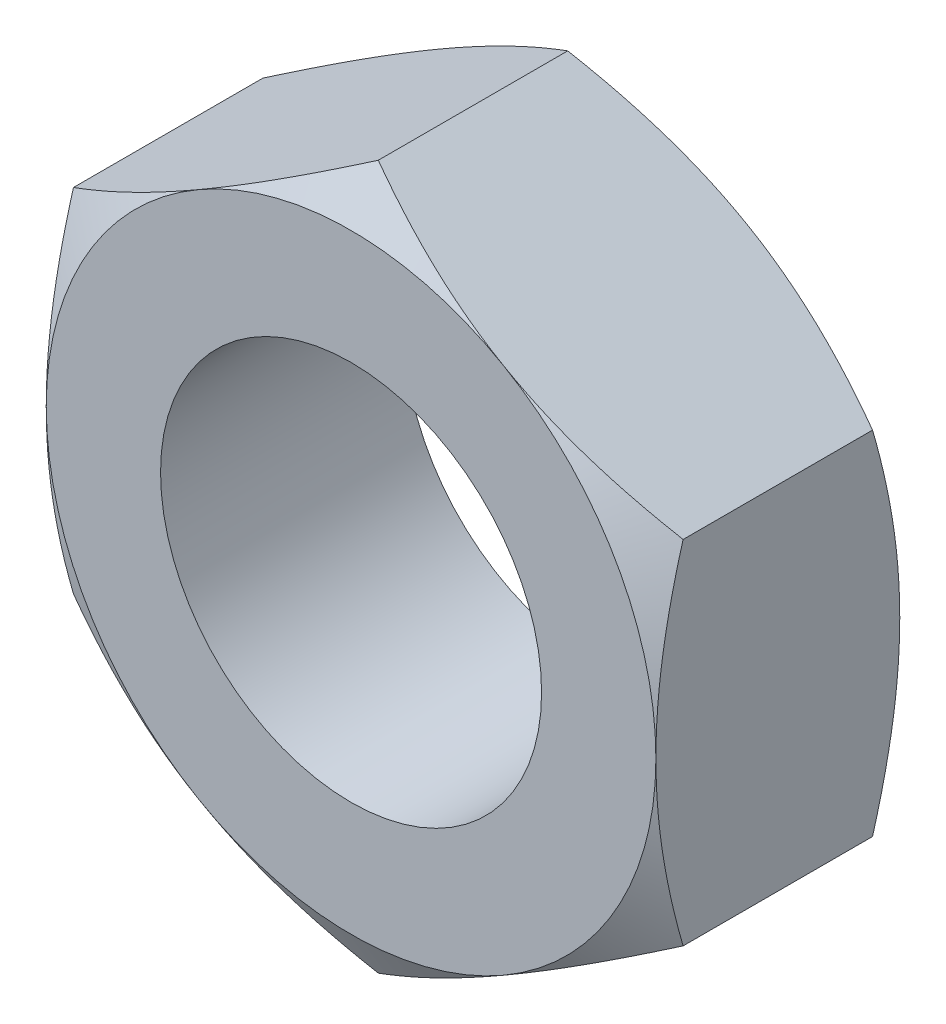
ISO-10303-21;
HEADER;
FILE_DESCRIPTION(('STEP AP214'),'2;1');
FILE_NAME('part.step','',(''),(''),'','','');
FILE_SCHEMA(('AUTOMOTIVE_DESIGN { 1 0 10303 214 1 1 1 1 }'));
ENDSEC;
DATA;
#1=APPLICATION_CONTEXT('core data for automotive mechanical design processes');
#2=APPLICATION_PROTOCOL_DEFINITION('international standard','automotive_design',2000,#1);
#3=PRODUCT_CONTEXT('',#1,'mechanical');
#4=PRODUCT('Part','Part','',(#3));
#5=PRODUCT_RELATED_PRODUCT_CATEGORY('part','',(#4));
#6=PRODUCT_DEFINITION_FORMATION('','',#4);
#7=PRODUCT_DEFINITION_CONTEXT('part definition',#1,'design');
#8=PRODUCT_DEFINITION('design','',#6,#7);
#9=PRODUCT_DEFINITION_SHAPE('','',#8);
#10=(LENGTH_UNIT() NAMED_UNIT(*) SI_UNIT(.MILLI.,.METRE.));
#11=(NAMED_UNIT(*) PLANE_ANGLE_UNIT() SI_UNIT($,.RADIAN.));
#12=(NAMED_UNIT(*) SI_UNIT($,.STERADIAN.) SOLID_ANGLE_UNIT());
#13=UNCERTAINTY_MEASURE_WITH_UNIT(LENGTH_MEASURE(1.E-05),#10,'distance_accuracy_value','');
#14=(GEOMETRIC_REPRESENTATION_CONTEXT(3) GLOBAL_UNCERTAINTY_ASSIGNED_CONTEXT((#13)) GLOBAL_UNIT_ASSIGNED_CONTEXT((#10,
#11,#12)) REPRESENTATION_CONTEXT('',''));
#15=CARTESIAN_POINT('',(0.,0.,0.));
#16=DIRECTION('',(0.,0.,1.));
#17=DIRECTION('',(1.,0.,0.));
#18=AXIS2_PLACEMENT_3D('',#15,#16,#17);
#19=CARTESIAN_POINT('',(-8.,13.856406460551,0.));
#20=DIRECTION('',(0.,0.,-1.));
#21=DIRECTION('',(-1.,0.,0.));
#22=AXIS2_PLACEMENT_3D('',#19,#20,#21);
#23=PLANE('',#22);
#24=CARTESIAN_POINT('',(0.,0.,0.));
#25=DIRECTION('',(0.,0.,1.));
#26=DIRECTION('',(1.,0.,0.));
#27=AXIS2_PLACEMENT_3D('',#24,#25,#26);
#28=CIRCLE('',#27,5.);
#29=CARTESIAN_POINT('',(5.,0.,0.));
#30=VERTEX_POINT('',#29);
#31=EDGE_CURVE('E320',#30,#30,#28,.T.);
#32=ORIENTED_EDGE('',*,*,#31,.F.);
#33=EDGE_LOOP('',(#32));
#34=FACE_BOUND('',#33,.T.);
#35=CARTESIAN_POINT('',(0.,0.,0.));
#36=DIRECTION('',(0.,0.,-1.));
#37=DIRECTION('',(-1.,0.,0.));
#38=AXIS2_PLACEMENT_3D('',#35,#36,#37);
#39=CIRCLE('',#38,8.);
#40=CARTESIAN_POINT('',(-8.,0.,0.));
#41=VERTEX_POINT('',#40);
#42=CARTESIAN_POINT('',(-4.,6.9282032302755,0.));
#43=VERTEX_POINT('',#42);
#44=EDGE_CURVE('E328',#41,#43,#39,.T.);
#45=ORIENTED_EDGE('',*,*,#44,.F.);
#46=CARTESIAN_POINT('',(0.,0.,0.));
#47=DIRECTION('',(0.,0.,-1.));
#48=DIRECTION('',(-1.,0.,0.));
#49=AXIS2_PLACEMENT_3D('',#46,#47,#48);
#50=CIRCLE('',#49,8.);
#51=CARTESIAN_POINT('',(-4.,-6.92820323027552,0.));
#52=VERTEX_POINT('',#51);
#53=EDGE_CURVE('E150',#41,#52,#50,.F.);
#54=ORIENTED_EDGE('',*,*,#53,.T.);
#55=CARTESIAN_POINT('',(4.,-6.92820323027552,0.));
#56=VERTEX_POINT('',#55);
#57=EDGE_CURVE('E252',#52,#56,#50,.F.);
#58=ORIENTED_EDGE('',*,*,#57,.T.);
#59=CARTESIAN_POINT('',(8.,0.,0.));
#60=VERTEX_POINT('',#59);
#61=EDGE_CURVE('E153',#56,#60,#50,.F.);
#62=ORIENTED_EDGE('',*,*,#61,.T.);
#63=CARTESIAN_POINT('',(4.,6.92820323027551,0.));
#64=VERTEX_POINT('',#63);
#65=EDGE_CURVE('E128',#60,#64,#50,.F.);
#66=ORIENTED_EDGE('',*,*,#65,.T.);
#67=EDGE_CURVE('E141',#64,#43,#50,.F.);
#68=ORIENTED_EDGE('',*,*,#67,.T.);
#69=EDGE_LOOP('',(#45,#54,#58,#62,#66,#68));
#70=FACE_BOUND('',#69,.T.);
#71=ADVANCED_FACE('F33',(#34,#70),#23,.F.);
#72=CARTESIAN_POINT('',(0.,0.,0.));
#73=DIRECTION('',(0.,0.,-1.));
#74=DIRECTION('',(-1.,0.,0.));
#75=AXIS2_PLACEMENT_3D('',#72,#73,#74);
#76=CONICAL_SURFACE('',#75,8.,1.0471975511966);
#77=CARTESIAN_POINT('',(-8.,-12.5978512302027,-3.99718793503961));
#78=CARTESIAN_POINT('',(-8.,-12.2467981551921,-3.82613583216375));
#79=CARTESIAN_POINT('',(-8.,-11.894959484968,-3.65666940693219));
#80=CARTESIAN_POINT('',(-8.,-11.1892938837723,-3.3217960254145));
#81=CARTESIAN_POINT('',(-8.,-10.8354666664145,-3.15638967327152));
#82=CARTESIAN_POINT('',(-8.,-10.1236737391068,-2.82973274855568));
#83=CARTESIAN_POINT('',(-8.,-9.76569608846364,-2.668508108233));
#84=CARTESIAN_POINT('',(-8.,-9.04695984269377,-2.35240577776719));
#85=CARTESIAN_POINT('',(-8.,-8.68620137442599,-2.19752780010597));
#86=CARTESIAN_POINT('',(-8.,-7.9489553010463,-1.89063692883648));
#87=CARTESIAN_POINT('',(-8.,-7.5723512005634,-1.73890239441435));
#88=CARTESIAN_POINT('',(-8.,-6.81480895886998,-1.44646097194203));
#89=CARTESIAN_POINT('',(-8.,-6.43387034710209,-1.30575529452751));
#90=CARTESIAN_POINT('',(-8.,-5.6677018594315,-1.03892643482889));
#91=CARTESIAN_POINT('',(-8.,-5.28248181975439,-0.912775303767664));
#92=CARTESIAN_POINT('',(-8.,-4.50653215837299,-0.678975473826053));
#93=CARTESIAN_POINT('',(-8.,-4.11580425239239,-0.571321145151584));
#94=CARTESIAN_POINT('',(-8.,-3.33077003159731,-0.380144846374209));
#95=CARTESIAN_POINT('',(-8.,-2.93649830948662,-0.296484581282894));
#96=CARTESIAN_POINT('',(-8.,-2.34135204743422,-0.192508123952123));
#97=CARTESIAN_POINT('',(-8.,-2.14233355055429,-0.161433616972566));
#98=CARTESIAN_POINT('',(-8.,-1.74324369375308,-0.107060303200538));
#99=CARTESIAN_POINT('',(-8.,-1.54317243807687,-0.0837607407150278));
#100=CARTESIAN_POINT('',(-8.,-1.14494144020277,-0.0457040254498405));
#101=CARTESIAN_POINT('',(-8.,-0.946792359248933,-0.0308357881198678));
#102=CARTESIAN_POINT('',(-8.,-0.550042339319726,-0.00949994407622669));
#103=CARTESIAN_POINT('',(-8.,-0.351441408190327,-0.00303219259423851));
#104=CARTESIAN_POINT('',(-8.,0.0458560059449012,0.00134752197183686));
#105=CARTESIAN_POINT('',(-8.,0.244552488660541,-0.000740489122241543));
#106=CARTESIAN_POINT('',(-8.,0.641676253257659,-0.0134190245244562));
#107=CARTESIAN_POINT('',(-8.,0.840103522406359,-0.0240099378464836));
#108=CARTESIAN_POINT('',(-8.,1.31131910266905,-0.0590283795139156));
#109=CARTESIAN_POINT('',(-8.,1.58383740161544,-0.0871749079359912));
#110=CARTESIAN_POINT('',(-8.,2.12696221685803,-0.158012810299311));
#111=CARTESIAN_POINT('',(-8.,2.39756848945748,-0.200706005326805));
#112=CARTESIAN_POINT('',(-8.,3.20614855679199,-0.348351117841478));
#113=CARTESIAN_POINT('',(-8.,3.74060747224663,-0.472845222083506));
#114=CARTESIAN_POINT('',(-8.,4.54001757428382,-0.690143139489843));
#115=CARTESIAN_POINT('',(-8.,4.80907665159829,-0.768716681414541));
#116=CARTESIAN_POINT('',(-8.,5.34458570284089,-0.934380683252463));
#117=CARTESIAN_POINT('',(-8.,5.61103565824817,-1.02147120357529));
#118=CARTESIAN_POINT('',(-8.,6.14140334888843,-1.20274259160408));
#119=CARTESIAN_POINT('',(-8.,6.40532179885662,-1.29692138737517));
#120=CARTESIAN_POINT('',(-8.,6.93094855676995,-1.49122593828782));
#121=CARTESIAN_POINT('',(-8.,7.19265690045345,-1.59135159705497));
#122=CARTESIAN_POINT('',(-8.,7.84544617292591,-1.8482572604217));
#123=CARTESIAN_POINT('',(-8.,8.23529223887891,-2.0081705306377));
#124=CARTESIAN_POINT('',(-8.,9.01133712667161,-2.33664301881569));
#125=CARTESIAN_POINT('',(-8.,9.39753564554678,-2.50520294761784));
#126=CARTESIAN_POINT('',(-8.,10.1670268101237,-2.84910950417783));
#127=CARTESIAN_POINT('',(-8.,10.5503185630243,-3.02445812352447));
#128=CARTESIAN_POINT('',(-8.,11.3144063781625,-3.38046716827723));
#129=CARTESIAN_POINT('',(-8.,11.6952025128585,-3.56112743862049));
#130=CARTESIAN_POINT('',(-8.,12.4552543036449,-3.92694277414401));
#131=CARTESIAN_POINT('',(-8.,12.834507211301,-4.11210353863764));
#132=CARTESIAN_POINT('',(-8.,13.5913102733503,-4.48587297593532));
#133=CARTESIAN_POINT('',(-8.,13.968860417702,-4.67448166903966));
#134=CARTESIAN_POINT('',(-8.,14.7224730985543,-5.05448653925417));
#135=CARTESIAN_POINT('',(-8.,15.0985358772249,-5.24588223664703));
#136=CARTESIAN_POINT('',(-8.,15.8494646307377,-5.63100852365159));
#137=CARTESIAN_POINT('',(-8.,16.2243306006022,-5.82473912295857));
#138=CARTESIAN_POINT('',(-8.,17.2776292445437,-6.37254658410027));
#139=CARTESIAN_POINT('',(-8.,17.9549068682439,-6.72884405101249));
#140=CARTESIAN_POINT('',(-8.,19.3069968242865,-7.44615128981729));
#141=CARTESIAN_POINT('',(-8.,19.9818090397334,-7.80716128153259));
#142=CARTESIAN_POINT('',(-8.,21.3275303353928,-8.53166575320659));
#143=CARTESIAN_POINT('',(-8.,21.9984450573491,-8.89514976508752));
#144=CARTESIAN_POINT('',(-8.,23.3387155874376,-9.62487632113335));
#145=CARTESIAN_POINT('',(-8.,24.00807149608,-9.99111868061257));
#146=CARTESIAN_POINT('',(-8.00000000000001,24.676865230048,-10.3583769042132));
#147=B_SPLINE_CURVE_WITH_KNOTS('',3,(#77,#78,#79,#80,#81,#82,#83,#84,#85,#86,#87,#88,#89,#90,
#91,#92,#93,#94,#95,#96,#97,#98,#99,#100,#101,#102,#103,#104,#105,#106,#107,#108,#109,#110,#111,
#112,#113,#114,#115,#116,#117,#118,#119,#120,#121,#122,#123,#124,#125,#126,#127,#128,#129,#130,
#131,#132,#133,#134,#135,#136,#137,#138,#139,#140,#141,#142,#143,#144,#145,#146),.UNSPECIFIED.,
.F.,.F.,(4,2,2,2,2,2,2,2,2,2,2,2,2,2,2,2,2,2,2,2,2,2,2,2,2,2,2,2,2,2,2,2,2,2,4),(0.,
1.17153964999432,2.34325258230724,3.52102841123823,4.698750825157,5.91668320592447,
7.13474909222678,8.35043558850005,9.56575141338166,10.7739148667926,11.3780765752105,
11.9821795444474,12.5781264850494,13.1740631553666,13.7699980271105,14.365960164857,
15.1874038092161,16.0089503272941,17.6528709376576,18.4936875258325,19.3345100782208,
20.1750878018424,21.0156519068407,22.2796134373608,23.5436790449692,24.8081183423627,
26.072520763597,27.3386176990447,28.6047220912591,29.8706110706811,31.136505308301,
33.4323157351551,35.7282336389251,38.0173800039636,40.3063744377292),.UNSPECIFIED.);
#148=CARTESIAN_POINT('',(-8.,4.618802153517,-0.714531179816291));
#149=VERTEX_POINT('',#148);
#150=EDGE_CURVE('E158',#149,#41,#147,.F.);
#151=ORIENTED_EDGE('',*,*,#150,.T.);
#152=ORIENTED_EDGE('',*,*,#44,.T.);
#153=CARTESIAN_POINT('',(0.000199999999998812,9.23771977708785,-0.714597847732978));
#154=CARTESIAN_POINT('',(-0.175648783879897,9.13619343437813,-0.655990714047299));
#155=CARTESIAN_POINT('',(-0.352153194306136,9.03428856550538,-0.600043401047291));
#156=CARTESIAN_POINT('',(-0.70659546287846,8.82965122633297,-0.494201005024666));
#157=CARTESIAN_POINT('',(-0.884533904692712,8.72691841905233,-0.444308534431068));
#158=CARTESIAN_POINT('',(-1.42119823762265,8.41707512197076,-0.304692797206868));
#159=CARTESIAN_POINT('',(-1.78204258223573,8.20874154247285,-0.225281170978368));
#160=CARTESIAN_POINT('',(-2.32203917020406,7.89697436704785,-0.13216164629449));
#161=CARTESIAN_POINT('',(-2.49957818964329,7.79447216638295,-0.105634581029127));
#162=CARTESIAN_POINT('',(-2.85545911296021,7.58900421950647,-0.0611531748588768));
#163=CARTESIAN_POINT('',(-3.03380094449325,7.4860385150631,-0.0431980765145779));
#164=CARTESIAN_POINT('',(-3.3907916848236,7.27992981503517,-0.0163156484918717));
#165=CARTESIAN_POINT('',(-3.56944001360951,7.17678715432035,-0.0073780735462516));
#166=CARTESIAN_POINT('',(-3.92690170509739,6.97040655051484,0.00127769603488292));
#167=CARTESIAN_POINT('',(-4.10571506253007,6.86716861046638,0.000996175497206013));
#168=CARTESIAN_POINT('',(-4.44001336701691,6.67416139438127,-0.00814502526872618));
#169=CARTESIAN_POINT('',(-4.59552190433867,6.58437849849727,-0.0158896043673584));
#170=CARTESIAN_POINT('',(-4.90617476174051,6.40502298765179,-0.0382011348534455));
#171=CARTESIAN_POINT('',(-5.06131905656,6.31545038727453,-0.052768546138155));
#172=CARTESIAN_POINT('',(-5.52615131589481,6.04707935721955,-0.106360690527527));
#173=CARTESIAN_POINT('',(-5.83501648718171,5.86875596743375,-0.155268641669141));
#174=CARTESIAN_POINT('',(-6.45602322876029,5.51021755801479,-0.277539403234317));
#175=CARTESIAN_POINT('',(-6.76808554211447,5.33004829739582,-0.351420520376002));
#176=CARTESIAN_POINT('',(-7.38755648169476,4.97239658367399,-0.519100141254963));
#177=CARTESIAN_POINT('',(-7.69497304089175,4.79490955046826,-0.612859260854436));
#178=CARTESIAN_POINT('',(-8.0002,4.61868668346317,-0.714597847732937));
#179=B_SPLINE_CURVE_WITH_KNOTS('',3,(#153,#154,#155,#156,#157,#158,#159,#160,#161,#162,#163,
#164,#165,#166,#167,#168,#169,#170,#171,#172,#173,#174,#175,#176,#177,#178),.UNSPECIFIED.,.F.,
.F.,(4,2,2,2,2,2,2,2,2,2,2,2,4),(0.,0.633973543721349,1.26821965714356,2.53934712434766,
3.1593434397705,3.77928496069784,4.39852133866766,5.01773858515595,5.55680239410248,
6.09590254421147,7.17487077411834,8.27776850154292,9.37850115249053),.UNSPECIFIED.);
#180=EDGE_CURVE('E190',#43,#149,#179,.T.);
#181=ORIENTED_EDGE('',*,*,#180,.T.);
#182=EDGE_LOOP('',(#151,#152,#181));
#183=FACE_BOUND('',#182,.T.);
#184=ADVANCED_FACE('F177',(#183),#76,.T.);
#185=CARTESIAN_POINT('',(8.0002,4.61868668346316,-0.714597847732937));
#186=CARTESIAN_POINT('',(7.8243512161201,4.7202130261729,-0.655990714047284));
#187=CARTESIAN_POINT('',(7.64784680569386,4.82211789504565,-0.600043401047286));
#188=CARTESIAN_POINT('',(7.29340453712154,5.02675523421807,-0.49420100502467));
#189=CARTESIAN_POINT('',(7.11546609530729,5.1294880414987,-0.444308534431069));
#190=CARTESIAN_POINT('',(6.57880176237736,5.43933133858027,-0.304692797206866));
#191=CARTESIAN_POINT('',(6.21795741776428,5.64766491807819,-0.225281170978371));
#192=CARTESIAN_POINT('',(5.67796082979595,5.95943209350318,-0.132161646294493));
#193=CARTESIAN_POINT('',(5.50042181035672,6.06193429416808,-0.105634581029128));
#194=CARTESIAN_POINT('',(5.1445408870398,6.26740224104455,-0.0611531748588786));
#195=CARTESIAN_POINT('',(4.96619905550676,6.37036794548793,-0.0431980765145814));
#196=CARTESIAN_POINT('',(4.60920831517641,6.57647664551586,-0.0163156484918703));
#197=CARTESIAN_POINT('',(4.4305599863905,6.67961930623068,-0.00737807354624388));
#198=CARTESIAN_POINT('',(4.07309829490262,6.88599991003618,0.00127769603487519));
#199=CARTESIAN_POINT('',(3.89428493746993,6.98923785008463,0.000996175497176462));
#200=CARTESIAN_POINT('',(3.55998663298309,7.18224506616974,-0.0081450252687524));
#201=CARTESIAN_POINT('',(3.40447809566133,7.27202796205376,-0.0158896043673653));
#202=CARTESIAN_POINT('',(3.0938252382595,7.45138347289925,-0.0382011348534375));
#203=CARTESIAN_POINT('',(2.93868094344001,7.54095607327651,-0.0527685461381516));
#204=CARTESIAN_POINT('',(2.47384868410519,7.80932710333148,-0.106360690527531));
#205=CARTESIAN_POINT('',(2.16498351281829,7.98765049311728,-0.155268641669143));
#206=CARTESIAN_POINT('',(1.54397677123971,8.34618890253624,-0.277539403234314));
#207=CARTESIAN_POINT('',(1.23191445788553,8.52635816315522,-0.351420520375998));
#208=CARTESIAN_POINT('',(0.612443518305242,8.88400987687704,-0.519100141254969));
#209=CARTESIAN_POINT('',(0.30502695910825,9.06149691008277,-0.612859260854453));
#210=CARTESIAN_POINT('',(-0.000199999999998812,9.23771977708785,-0.714597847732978));
#211=B_SPLINE_CURVE_WITH_KNOTS('',3,(#185,#186,#187,#188,#189,#190,#191,#192,#193,#194,#195,
#196,#197,#198,#199,#200,#201,#202,#203,#204,#205,#206,#207,#208,#209,#210),.UNSPECIFIED.,.F.,
.F.,(4,2,2,2,2,2,2,2,2,2,2,2,4),(0.,0.633973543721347,1.26821965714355,2.53934712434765,
3.15934343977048,3.77928496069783,4.39852133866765,5.01773858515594,5.55680239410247,
6.09590254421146,7.17487077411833,8.27776850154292,9.37850115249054),.UNSPECIFIED.);
#212=CARTESIAN_POINT('',(0.,9.237604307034,-0.714531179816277));
#213=VERTEX_POINT('',#212);
#214=EDGE_CURVE('E137',#64,#213,#211,.T.);
#215=ORIENTED_EDGE('',*,*,#214,.T.);
#216=EDGE_CURVE('E144',#213,#43,#179,.T.);
#217=ORIENTED_EDGE('',*,*,#216,.T.);
#218=ORIENTED_EDGE('',*,*,#67,.F.);
#219=EDGE_LOOP('',(#215,#217,#218));
#220=FACE_BOUND('',#219,.T.);
#221=ADVANCED_FACE('F142',(#220),#76,.T.);
#222=CARTESIAN_POINT('',(8.,-12.5978512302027,-3.99718793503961));
#223=CARTESIAN_POINT('',(8.,-12.2467981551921,-3.82613583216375));
#224=CARTESIAN_POINT('',(8.,-11.894959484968,-3.65666940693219));
#225=CARTESIAN_POINT('',(8.,-11.1892938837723,-3.3217960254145));
#226=CARTESIAN_POINT('',(8.,-10.8354666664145,-3.15638967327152));
#227=CARTESIAN_POINT('',(8.,-10.1236737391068,-2.82973274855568));
#228=CARTESIAN_POINT('',(8.,-9.76569608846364,-2.668508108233));
#229=CARTESIAN_POINT('',(8.,-9.04695984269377,-2.35240577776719));
#230=CARTESIAN_POINT('',(8.,-8.68620137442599,-2.19752780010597));
#231=CARTESIAN_POINT('',(8.,-7.9489553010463,-1.89063692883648));
#232=CARTESIAN_POINT('',(8.,-7.5723512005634,-1.73890239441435));
#233=CARTESIAN_POINT('',(8.,-6.81480895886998,-1.44646097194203));
#234=CARTESIAN_POINT('',(8.,-6.43387034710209,-1.30575529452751));
#235=CARTESIAN_POINT('',(8.,-5.6677018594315,-1.03892643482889));
#236=CARTESIAN_POINT('',(8.,-5.28248181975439,-0.912775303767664));
#237=CARTESIAN_POINT('',(8.,-4.50653215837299,-0.678975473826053));
#238=CARTESIAN_POINT('',(8.,-4.11580425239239,-0.571321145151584));
#239=CARTESIAN_POINT('',(8.,-3.33077003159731,-0.380144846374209));
#240=CARTESIAN_POINT('',(8.,-2.93649830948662,-0.296484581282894));
#241=CARTESIAN_POINT('',(8.,-2.34135204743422,-0.192508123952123));
#242=CARTESIAN_POINT('',(8.,-2.14233355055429,-0.161433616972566));
#243=CARTESIAN_POINT('',(8.,-1.74324369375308,-0.107060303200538));
#244=CARTESIAN_POINT('',(8.,-1.54317243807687,-0.0837607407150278));
#245=CARTESIAN_POINT('',(8.,-1.14494144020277,-0.0457040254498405));
#246=CARTESIAN_POINT('',(8.,-0.946792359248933,-0.0308357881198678));
#247=CARTESIAN_POINT('',(8.,-0.550042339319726,-0.00949994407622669));
#248=CARTESIAN_POINT('',(8.,-0.351441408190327,-0.00303219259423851));
#249=CARTESIAN_POINT('',(8.,0.0458560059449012,0.00134752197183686));
#250=CARTESIAN_POINT('',(8.,0.244552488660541,-0.000740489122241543));
#251=CARTESIAN_POINT('',(8.,0.641676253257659,-0.0134190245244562));
#252=CARTESIAN_POINT('',(8.,0.840103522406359,-0.0240099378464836));
#253=CARTESIAN_POINT('',(8.,1.31131910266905,-0.0590283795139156));
#254=CARTESIAN_POINT('',(8.,1.58383740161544,-0.0871749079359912));
#255=CARTESIAN_POINT('',(8.,2.12696221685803,-0.158012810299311));
#256=CARTESIAN_POINT('',(8.,2.39756848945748,-0.200706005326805));
#257=CARTESIAN_POINT('',(8.,3.20614855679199,-0.348351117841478));
#258=CARTESIAN_POINT('',(8.,3.74060747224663,-0.472845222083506));
#259=CARTESIAN_POINT('',(8.,4.54001757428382,-0.690143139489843));
#260=CARTESIAN_POINT('',(8.,4.80907665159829,-0.768716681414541));
#261=CARTESIAN_POINT('',(8.,5.34458570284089,-0.934380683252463));
#262=CARTESIAN_POINT('',(8.,5.61103565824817,-1.02147120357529));
#263=CARTESIAN_POINT('',(8.,6.14140334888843,-1.20274259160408));
#264=CARTESIAN_POINT('',(8.,6.40532179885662,-1.29692138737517));
#265=CARTESIAN_POINT('',(8.,6.93094855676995,-1.49122593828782));
#266=CARTESIAN_POINT('',(8.,7.19265690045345,-1.59135159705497));
#267=CARTESIAN_POINT('',(8.,7.84544617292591,-1.8482572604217));
#268=CARTESIAN_POINT('',(8.,8.23529223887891,-2.0081705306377));
#269=CARTESIAN_POINT('',(8.,9.01133712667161,-2.33664301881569));
#270=CARTESIAN_POINT('',(8.,9.39753564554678,-2.50520294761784));
#271=CARTESIAN_POINT('',(8.,10.1670268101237,-2.84910950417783));
#272=CARTESIAN_POINT('',(8.,10.5503185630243,-3.02445812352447));
#273=CARTESIAN_POINT('',(8.,11.3144063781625,-3.38046716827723));
#274=CARTESIAN_POINT('',(8.,11.6952025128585,-3.56112743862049));
#275=CARTESIAN_POINT('',(8.,12.4552543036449,-3.92694277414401));
#276=CARTESIAN_POINT('',(8.,12.834507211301,-4.11210353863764));
#277=CARTESIAN_POINT('',(8.,13.5913102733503,-4.48587297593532));
#278=CARTESIAN_POINT('',(8.,13.968860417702,-4.67448166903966));
#279=CARTESIAN_POINT('',(8.,14.7224730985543,-5.05448653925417));
#280=CARTESIAN_POINT('',(8.,15.0985358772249,-5.24588223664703));
#281=CARTESIAN_POINT('',(8.,15.8494646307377,-5.63100852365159));
#282=CARTESIAN_POINT('',(8.,16.2243306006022,-5.82473912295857));
#283=CARTESIAN_POINT('',(8.,17.2776292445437,-6.37254658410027));
#284=CARTESIAN_POINT('',(8.,17.9549068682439,-6.72884405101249));
#285=CARTESIAN_POINT('',(8.,19.3069968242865,-7.44615128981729));
#286=CARTESIAN_POINT('',(8.,19.9818090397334,-7.80716128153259));
#287=CARTESIAN_POINT('',(8.,21.3275303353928,-8.53166575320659));
#288=CARTESIAN_POINT('',(8.,21.9984450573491,-8.89514976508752));
#289=CARTESIAN_POINT('',(8.,23.3387155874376,-9.62487632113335));
#290=CARTESIAN_POINT('',(8.,24.00807149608,-9.99111868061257));
#291=CARTESIAN_POINT('',(8.,24.676865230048,-10.3583769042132));
#292=B_SPLINE_CURVE_WITH_KNOTS('',3,(#222,#223,#224,#225,#226,#227,#228,#229,#230,#231,#232,
#233,#234,#235,#236,#237,#238,#239,#240,#241,#242,#243,#244,#245,#246,#247,#248,#249,#250,#251,
#252,#253,#254,#255,#256,#257,#258,#259,#260,#261,#262,#263,#264,#265,#266,#267,#268,#269,#270,
#271,#272,#273,#274,#275,#276,#277,#278,#279,#280,#281,#282,#283,#284,#285,#286,#287,#288,#289,
#290,#291),.UNSPECIFIED.,.F.,.F.,(4,2,2,2,2,2,2,2,2,2,2,2,2,2,2,2,2,2,2,2,2,2,2,2,2,2,2,2,2,2,2,
2,2,2,4),(0.,1.17153964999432,2.34325258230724,3.52102841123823,4.698750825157,5.91668320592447,
7.13474909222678,8.35043558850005,9.56575141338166,10.7739148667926,11.3780765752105,
11.9821795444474,12.5781264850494,13.1740631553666,13.7699980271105,14.365960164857,
15.1874038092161,16.0089503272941,17.6528709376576,18.4936875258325,19.3345100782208,
20.1750878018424,21.0156519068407,22.2796134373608,23.5436790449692,24.8081183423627,
26.072520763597,27.3386176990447,28.6047220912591,29.8706110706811,31.136505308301,
33.4323157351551,35.7282336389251,38.0173800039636,40.3063744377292),.UNSPECIFIED.);
#293=CARTESIAN_POINT('',(8.,4.618802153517,-0.714531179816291));
#294=VERTEX_POINT('',#293);
#295=EDGE_CURVE('E131',#60,#294,#292,.T.);
#296=ORIENTED_EDGE('',*,*,#295,.T.);
#297=EDGE_CURVE('E124',#294,#64,#211,.T.);
#298=ORIENTED_EDGE('',*,*,#297,.T.);
#299=ORIENTED_EDGE('',*,*,#65,.F.);
#300=EDGE_LOOP('',(#296,#298,#299));
#301=FACE_BOUND('',#300,.T.);
#302=ADVANCED_FACE('F126',(#301),#76,.T.);
#303=CARTESIAN_POINT('',(-0.000199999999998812,-9.23771977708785,-0.714597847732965));
#304=CARTESIAN_POINT('',(0.175648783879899,-9.13619343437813,-0.655990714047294));
#305=CARTESIAN_POINT('',(0.352153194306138,-9.03428856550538,-0.600043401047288));
#306=CARTESIAN_POINT('',(0.706595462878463,-8.82965122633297,-0.494201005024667));
#307=CARTESIAN_POINT('',(0.884533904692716,-8.72691841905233,-0.444308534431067));
#308=CARTESIAN_POINT('',(1.42119823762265,-8.41707512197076,-0.304692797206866));
#309=CARTESIAN_POINT('',(1.78204258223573,-8.20874154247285,-0.225281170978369));
#310=CARTESIAN_POINT('',(2.32203917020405,-7.89697436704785,-0.132161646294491));
#311=CARTESIAN_POINT('',(2.49957818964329,-7.79447216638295,-0.105634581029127));
#312=CARTESIAN_POINT('',(2.8554591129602,-7.58900421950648,-0.0611531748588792));
#313=CARTESIAN_POINT('',(3.03380094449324,-7.48603851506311,-0.0431980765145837));
#314=CARTESIAN_POINT('',(3.3907916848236,-7.27992981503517,-0.0163156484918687));
#315=CARTESIAN_POINT('',(3.5694400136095,-7.17678715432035,-0.0073780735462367));
#316=CARTESIAN_POINT('',(3.92690170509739,-6.97040655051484,0.00127769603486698));
#317=CARTESIAN_POINT('',(4.10571506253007,-6.86716861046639,0.00099617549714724));
#318=CARTESIAN_POINT('',(4.44001336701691,-6.67416139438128,-0.00814502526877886));
#319=CARTESIAN_POINT('',(4.59552190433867,-6.58437849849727,-0.0158896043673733));
#320=CARTESIAN_POINT('',(4.90617476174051,-6.40502298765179,-0.0382011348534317));
#321=CARTESIAN_POINT('',(5.06131905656,-6.31545038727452,-0.0527685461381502));
#322=CARTESIAN_POINT('',(5.52615131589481,-6.04707935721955,-0.106360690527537));
#323=CARTESIAN_POINT('',(5.83501648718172,-5.86875596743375,-0.155268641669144));
#324=CARTESIAN_POINT('',(6.45602322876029,-5.51021755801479,-0.277539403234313));
#325=CARTESIAN_POINT('',(6.76808554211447,-5.33004829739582,-0.351420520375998));
#326=CARTESIAN_POINT('',(7.38755648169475,-4.97239658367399,-0.519100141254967));
#327=CARTESIAN_POINT('',(7.69497304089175,-4.79490955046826,-0.612859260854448));
#328=CARTESIAN_POINT('',(8.0002,-4.61868668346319,-0.714597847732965));
#329=B_SPLINE_CURVE_WITH_KNOTS('',3,(#303,#304,#305,#306,#307,#308,#309,#310,#311,#312,#313,
#314,#315,#316,#317,#318,#319,#320,#321,#322,#323,#324,#325,#326,#327,#328),.UNSPECIFIED.,.F.,
.F.,(4,2,2,2,2,2,2,2,2,2,2,2,4),(0.,0.633973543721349,1.26821965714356,2.53934712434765,
3.15934343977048,3.77928496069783,4.39852133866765,5.01773858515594,5.55680239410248,
6.09590254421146,7.17487077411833,8.2777685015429,9.37850115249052),.UNSPECIFIED.);
#330=CARTESIAN_POINT('',(8.,-4.61880215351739,-0.714531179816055));
#331=VERTEX_POINT('',#330);
#332=EDGE_CURVE('E204',#56,#331,#329,.T.);
#333=ORIENTED_EDGE('',*,*,#332,.T.);
#334=EDGE_CURVE('E203',#331,#60,#292,.T.);
#335=ORIENTED_EDGE('',*,*,#334,.T.);
#336=ORIENTED_EDGE('',*,*,#61,.F.);
#337=EDGE_LOOP('',(#333,#335,#336));
#338=FACE_BOUND('',#337,.T.);
#339=ADVANCED_FACE('F428',(#338),#76,.T.);
#340=CARTESIAN_POINT('',(0.,-9.23760430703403,-0.714531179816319));
#341=VERTEX_POINT('',#340);
#342=EDGE_CURVE('E262',#341,#56,#329,.T.);
#343=ORIENTED_EDGE('',*,*,#342,.T.);
#344=ORIENTED_EDGE('',*,*,#57,.F.);
#345=CARTESIAN_POINT('',(-8.0002,-4.61868668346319,-0.714597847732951));
#346=CARTESIAN_POINT('',(-7.8243512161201,-4.72021302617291,-0.655990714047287));
#347=CARTESIAN_POINT('',(-7.64784680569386,-4.82211789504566,-0.600043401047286));
#348=CARTESIAN_POINT('',(-7.29340453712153,-5.02675523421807,-0.494201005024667));
#349=CARTESIAN_POINT('',(-7.11546609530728,-5.12948804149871,-0.444308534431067));
#350=CARTESIAN_POINT('',(-6.57880176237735,-5.43933133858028,-0.304692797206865));
#351=CARTESIAN_POINT('',(-6.21795741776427,-5.64766491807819,-0.225281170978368));
#352=CARTESIAN_POINT('',(-5.67796082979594,-5.95943209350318,-0.13216164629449));
#353=CARTESIAN_POINT('',(-5.50042181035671,-6.06193429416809,-0.105634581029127));
#354=CARTESIAN_POINT('',(-5.14454088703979,-6.26740224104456,-0.0611531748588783));
#355=CARTESIAN_POINT('',(-4.96619905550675,-6.37036794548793,-0.0431980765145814));
#356=CARTESIAN_POINT('',(-4.6092083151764,-6.57647664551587,-0.0163156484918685));
#357=CARTESIAN_POINT('',(-4.43055998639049,-6.67961930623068,-0.00737807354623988));
#358=CARTESIAN_POINT('',(-4.07309829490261,-6.88599991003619,0.00127769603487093));
#359=CARTESIAN_POINT('',(-3.89428493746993,-6.98923785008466,0.000996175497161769));
#360=CARTESIAN_POINT('',(-3.55998663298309,-7.18224506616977,-0.00814502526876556));
#361=CARTESIAN_POINT('',(-3.40447809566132,-7.27202796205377,-0.0158896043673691));
#362=CARTESIAN_POINT('',(-3.09382523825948,-7.45138347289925,-0.0382011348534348));
#363=CARTESIAN_POINT('',(-2.93868094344,-7.54095607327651,-0.0527685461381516));
#364=CARTESIAN_POINT('',(-2.47384868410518,-7.80932710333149,-0.106360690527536));
#365=CARTESIAN_POINT('',(-2.16498351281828,-7.98765049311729,-0.155268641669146));
#366=CARTESIAN_POINT('',(-1.5439767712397,-8.34618890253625,-0.277539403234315));
#367=CARTESIAN_POINT('',(-1.23191445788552,-8.52635816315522,-0.351420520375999));
#368=CARTESIAN_POINT('',(-0.612443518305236,-8.88400987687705,-0.51910014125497));
#369=CARTESIAN_POINT('',(-0.305026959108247,-9.06149691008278,-0.612859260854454));
#370=CARTESIAN_POINT('',(0.000199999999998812,-9.23771977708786,-0.714597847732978));
#371=B_SPLINE_CURVE_WITH_KNOTS('',3,(#345,#346,#347,#348,#349,#350,#351,#352,#353,#354,#355,
#356,#357,#358,#359,#360,#361,#362,#363,#364,#365,#366,#367,#368,#369,#370),.UNSPECIFIED.,.F.,
.F.,(4,2,2,2,2,2,2,2,2,2,2,2,4),(0.,0.633973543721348,1.26821965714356,2.53934712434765,
3.15934343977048,3.77928496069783,4.39852133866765,5.01773858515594,5.55680239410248,
6.09590254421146,7.17487077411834,8.27776850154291,9.37850115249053),.UNSPECIFIED.);
#372=EDGE_CURVE('E266',#52,#341,#371,.T.);
#373=ORIENTED_EDGE('',*,*,#372,.T.);
#374=EDGE_LOOP('',(#343,#344,#373));
#375=FACE_BOUND('',#374,.T.);
#376=ADVANCED_FACE('F183',(#375),#76,.T.);
#377=CARTESIAN_POINT('',(-8.,-4.61880215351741,-0.714531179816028));
#378=VERTEX_POINT('',#377);
#379=EDGE_CURVE('E171',#378,#52,#371,.T.);
#380=ORIENTED_EDGE('',*,*,#379,.T.);
#381=ORIENTED_EDGE('',*,*,#53,.F.);
#382=EDGE_CURVE('E136',#41,#378,#147,.F.);
#383=ORIENTED_EDGE('',*,*,#382,.T.);
#384=EDGE_LOOP('',(#380,#381,#383));
#385=FACE_BOUND('',#384,.T.);
#386=ADVANCED_FACE('F271',(#385),#76,.T.);
#387=CARTESIAN_POINT('',(8.,4.61880215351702,-6.4));
#388=DIRECTION('',(0.499999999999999,0.866025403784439,0.));
#389=DIRECTION('',(-0.866025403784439,0.5,0.));
#390=AXIS2_PLACEMENT_3D('',#387,#388,#389);
#391=PLANE('',#390);
#392=CARTESIAN_POINT('',(-0.000200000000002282,9.23771977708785,-5.68540215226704));
#393=CARTESIAN_POINT('',(0.175648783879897,9.13619343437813,-5.7440092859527));
#394=CARTESIAN_POINT('',(0.352153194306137,9.03428856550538,-5.79995659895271));
#395=CARTESIAN_POINT('',(0.706595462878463,8.82965122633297,-5.90579899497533));
#396=CARTESIAN_POINT('',(0.884533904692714,8.72691841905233,-5.95569146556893));
#397=CARTESIAN_POINT('',(1.42119823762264,8.41707512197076,-6.09530720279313));
#398=CARTESIAN_POINT('',(1.78204258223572,8.20874154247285,-6.17471882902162));
#399=CARTESIAN_POINT('',(2.32203917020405,7.89697436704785,-6.2678383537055));
#400=CARTESIAN_POINT('',(2.49957818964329,7.79447216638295,-6.29436541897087));
#401=CARTESIAN_POINT('',(2.8554591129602,7.58900421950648,-6.33884682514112));
#402=CARTESIAN_POINT('',(3.03380094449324,7.48603851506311,-6.35680192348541));
#403=CARTESIAN_POINT('',(3.39079168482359,7.27992981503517,-6.38368435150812));
#404=CARTESIAN_POINT('',(3.5694400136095,7.17678715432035,-6.39262192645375));
#405=CARTESIAN_POINT('',(3.92690170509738,6.97040655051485,-6.40127769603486));
#406=CARTESIAN_POINT('',(4.10571506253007,6.86716861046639,-6.40099617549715));
#407=CARTESIAN_POINT('',(4.44001336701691,6.67416139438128,-6.39185497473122));
#408=CARTESIAN_POINT('',(4.59552190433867,6.58437849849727,-6.38411039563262));
#409=CARTESIAN_POINT('',(4.90617476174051,6.40502298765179,-6.36179886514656));
#410=CARTESIAN_POINT('',(5.06131905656,6.31545038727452,-6.34723145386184));
#411=CARTESIAN_POINT('',(5.52615131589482,6.04707935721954,-6.29363930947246));
#412=CARTESIAN_POINT('',(5.83501648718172,5.86875596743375,-6.24473135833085));
#413=CARTESIAN_POINT('',(6.4560232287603,5.51021755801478,-6.12246059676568));
#414=CARTESIAN_POINT('',(6.76808554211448,5.33004829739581,-6.04857947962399));
#415=CARTESIAN_POINT('',(7.38755648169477,4.97239658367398,-5.88089985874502));
#416=CARTESIAN_POINT('',(7.69497304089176,4.79490955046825,-5.78714073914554));
#417=CARTESIAN_POINT('',(8.0002,4.61868668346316,-5.68540215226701));
#418=B_SPLINE_CURVE_WITH_KNOTS('',3,(#392,#393,#394,#395,#396,#397,#398,#399,#400,#401,#402,
#403,#404,#405,#406,#407,#408,#409,#410,#411,#412,#413,#414,#415,#416,#417),.UNSPECIFIED.,.F.,
.F.,(4,2,2,2,2,2,2,2,2,2,2,2,4),(0.,0.633973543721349,1.26821965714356,2.53934712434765,
3.15934343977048,3.77928496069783,4.39852133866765,5.01773858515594,5.55680239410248,
6.09590254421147,7.17487077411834,8.27776850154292,9.37850115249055),.UNSPECIFIED.);
#419=CARTESIAN_POINT('',(0.,9.237604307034,-5.68546882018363));
#420=VERTEX_POINT('',#419);
#421=CARTESIAN_POINT('',(3.99999999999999,6.92820323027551,-6.4));
#422=VERTEX_POINT('',#421);
#423=EDGE_CURVE('E237',#420,#422,#418,.T.);
#424=ORIENTED_EDGE('',*,*,#423,.F.);
#425=DIRECTION('',(0.,0.,1.));
#426=VECTOR('',#425,1.);
#427=CARTESIAN_POINT('',(0.,9.237604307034,-6.4));
#428=LINE('',#427,#426);
#429=EDGE_CURVE('E157',#420,#213,#428,.T.);
#430=ORIENTED_EDGE('',*,*,#429,.T.);
#431=ORIENTED_EDGE('',*,*,#214,.F.);
#432=ORIENTED_EDGE('',*,*,#297,.F.);
#433=DIRECTION('',(0.,0.,1.));
#434=VECTOR('',#433,1.);
#435=CARTESIAN_POINT('',(8.,4.61880215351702,-6.4));
#436=LINE('',#435,#434);
#437=CARTESIAN_POINT('',(8.,4.61880215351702,-5.68546882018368));
#438=VERTEX_POINT('',#437);
#439=EDGE_CURVE('E149',#438,#294,#436,.T.);
#440=ORIENTED_EDGE('',*,*,#439,.F.);
#441=EDGE_CURVE('E232',#422,#438,#418,.T.);
#442=ORIENTED_EDGE('',*,*,#441,.F.);
#443=EDGE_LOOP('',(#424,#430,#431,#432,#440,#442));
#444=FACE_BOUND('',#443,.T.);
#445=ADVANCED_FACE('F35',(#444),#391,.T.);
#446=CARTESIAN_POINT('',(8.,-4.61880215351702,-6.4));
#447=DIRECTION('',(1.,0.,0.));
#448=DIRECTION('',(0.,0.,-1.));
#449=AXIS2_PLACEMENT_3D('',#446,#447,#448);
#450=PLANE('',#449);
#451=CARTESIAN_POINT('',(8.,-12.5978512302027,-2.40281206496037));
#452=CARTESIAN_POINT('',(8.,-12.2467981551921,-2.57386416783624));
#453=CARTESIAN_POINT('',(8.,-11.894959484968,-2.7433305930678));
#454=CARTESIAN_POINT('',(8.,-11.1892938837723,-3.0782039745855));
#455=CARTESIAN_POINT('',(8.,-10.8354666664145,-3.24361032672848));
#456=CARTESIAN_POINT('',(8.,-10.1236737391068,-3.57026725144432));
#457=CARTESIAN_POINT('',(8.,-9.76569608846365,-3.73149189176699));
#458=CARTESIAN_POINT('',(8.,-9.04695984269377,-4.04759422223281));
#459=CARTESIAN_POINT('',(8.,-8.686201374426,-4.20247219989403));
#460=CARTESIAN_POINT('',(8.,-7.94895530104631,-4.50936307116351));
#461=CARTESIAN_POINT('',(8.,-7.57235120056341,-4.66109760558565));
#462=CARTESIAN_POINT('',(8.,-6.81480895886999,-4.95353902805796));
#463=CARTESIAN_POINT('',(8.,-6.4338703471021,-5.09424470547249));
#464=CARTESIAN_POINT('',(8.,-5.66770185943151,-5.36107356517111));
#465=CARTESIAN_POINT('',(8.,-5.2824818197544,-5.48722469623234));
#466=CARTESIAN_POINT('',(8.,-4.50653215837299,-5.72102452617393));
#467=CARTESIAN_POINT('',(8.,-4.11580425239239,-5.82867885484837));
#468=CARTESIAN_POINT('',(8.,-3.33077003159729,-6.01985515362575));
#469=CARTESIAN_POINT('',(8.,-2.93649830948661,-6.1035154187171));
#470=CARTESIAN_POINT('',(8.,-2.3413520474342,-6.20749187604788));
#471=CARTESIAN_POINT('',(8.,-2.14233355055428,-6.23856638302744));
#472=CARTESIAN_POINT('',(8.,-1.74324369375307,-6.29293969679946));
#473=CARTESIAN_POINT('',(8.,-1.54317243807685,-6.31623925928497));
#474=CARTESIAN_POINT('',(8.,-1.14494144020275,-6.35429597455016));
#475=CARTESIAN_POINT('',(8.,-0.946792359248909,-6.36916421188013));
#476=CARTESIAN_POINT('',(8.,-0.5500423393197,-6.39050005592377));
#477=CARTESIAN_POINT('',(8.,-0.351441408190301,-6.39696780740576));
#478=CARTESIAN_POINT('',(8.,0.0458560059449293,-6.40134752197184));
#479=CARTESIAN_POINT('',(8.,0.24455248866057,-6.39925951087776));
#480=CARTESIAN_POINT('',(8.,0.64167625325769,-6.38658097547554));
#481=CARTESIAN_POINT('',(8.,0.840103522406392,-6.37599006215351));
#482=CARTESIAN_POINT('',(8.,1.31131910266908,-6.34097162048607));
#483=CARTESIAN_POINT('',(8.,1.58383740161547,-6.312825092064));
#484=CARTESIAN_POINT('',(8.,2.12696221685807,-6.24198718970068));
#485=CARTESIAN_POINT('',(8.,2.39756848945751,-6.19929399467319));
#486=CARTESIAN_POINT('',(8.,3.20614855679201,-6.05164888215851));
#487=CARTESIAN_POINT('',(8.,3.74060747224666,-5.92715477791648));
#488=CARTESIAN_POINT('',(8.,4.54001757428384,-5.70985686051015));
#489=CARTESIAN_POINT('',(8.,4.80907665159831,-5.63128331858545));
#490=CARTESIAN_POINT('',(8.,5.3445857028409,-5.46561931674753));
#491=CARTESIAN_POINT('',(8.,5.61103565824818,-5.3785287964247));
#492=CARTESIAN_POINT('',(8.,6.14140334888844,-5.19725740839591));
#493=CARTESIAN_POINT('',(8.,6.40532179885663,-5.10307861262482));
#494=CARTESIAN_POINT('',(8.,6.93094855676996,-4.90877406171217));
#495=CARTESIAN_POINT('',(8.,7.19265690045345,-4.80864840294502));
#496=CARTESIAN_POINT('',(8.,7.84544617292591,-4.55174273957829));
#497=CARTESIAN_POINT('',(8.,8.23529223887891,-4.39182946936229));
#498=CARTESIAN_POINT('',(8.,9.01133712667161,-4.0633569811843));
#499=CARTESIAN_POINT('',(8.,9.39753564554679,-3.89479705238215));
#500=CARTESIAN_POINT('',(8.,10.1670268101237,-3.55089049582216));
#501=CARTESIAN_POINT('',(8.,10.5503185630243,-3.37554187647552));
#502=CARTESIAN_POINT('',(8.,11.3144063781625,-3.01953283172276));
#503=CARTESIAN_POINT('',(8.,11.6952025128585,-2.8388725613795));
#504=CARTESIAN_POINT('',(8.,12.4552543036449,-2.47305722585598));
#505=CARTESIAN_POINT('',(8.,12.834507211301,-2.28789646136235));
#506=CARTESIAN_POINT('',(8.,13.5913102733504,-1.91412702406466));
#507=CARTESIAN_POINT('',(8.,13.968860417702,-1.72551833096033));
#508=CARTESIAN_POINT('',(8.,14.7224730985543,-1.34551346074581));
#509=CARTESIAN_POINT('',(8.,15.0985358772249,-1.15411776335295));
#510=CARTESIAN_POINT('',(8.,15.8494646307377,-0.768991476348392));
#511=CARTESIAN_POINT('',(8.,16.2243306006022,-0.57526087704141));
#512=CARTESIAN_POINT('',(8.,17.2776292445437,-0.0274534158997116));
#513=CARTESIAN_POINT('',(8.,17.9549068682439,0.328844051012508));
#514=CARTESIAN_POINT('',(8.,19.3069968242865,1.0461512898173));
#515=CARTESIAN_POINT('',(8.,19.9818090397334,1.40716128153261));
#516=CARTESIAN_POINT('',(8.,21.3275303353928,2.1316657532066));
#517=CARTESIAN_POINT('',(8.,21.9984450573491,2.49514976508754));
#518=CARTESIAN_POINT('',(8.,23.3387155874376,3.22487632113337));
#519=CARTESIAN_POINT('',(8.,24.00807149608,3.59111868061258));
#520=CARTESIAN_POINT('',(8.,24.676865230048,3.95837690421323));
#521=B_SPLINE_CURVE_WITH_KNOTS('',3,(#451,#452,#453,#454,#455,#456,#457,#458,#459,#460,#461,
#462,#463,#464,#465,#466,#467,#468,#469,#470,#471,#472,#473,#474,#475,#476,#477,#478,#479,#480,
#481,#482,#483,#484,#485,#486,#487,#488,#489,#490,#491,#492,#493,#494,#495,#496,#497,#498,#499,
#500,#501,#502,#503,#504,#505,#506,#507,#508,#509,#510,#511,#512,#513,#514,#515,#516,#517,#518,
#519,#520),.UNSPECIFIED.,.F.,.F.,(4,2,2,2,2,2,2,2,2,2,2,2,2,2,2,2,2,2,2,2,2,2,2,2,2,2,2,2,2,2,2,
2,2,2,4),(0.,1.17153964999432,2.34325258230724,3.52102841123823,4.69875082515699,
5.91668320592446,7.13474909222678,8.35043558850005,9.56575141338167,10.7739148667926,
11.3780765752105,11.9821795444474,12.5781264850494,13.1740631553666,13.7699980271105,
14.365960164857,15.1874038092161,16.0089503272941,17.6528709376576,18.4936875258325,
19.3345100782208,20.1750878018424,21.0156519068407,22.2796134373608,23.5436790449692,
24.8081183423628,26.072520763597,27.3386176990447,28.6047220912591,29.8706110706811,
31.136505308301,33.4323157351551,35.7282336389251,38.0173800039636,40.3063744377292),.UNSPECIFIED.);
#522=CARTESIAN_POINT('',(8.,0.,-6.40000000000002));
#523=VERTEX_POINT('',#522);
#524=EDGE_CURVE('E226',#438,#523,#521,.F.);
#525=ORIENTED_EDGE('',*,*,#524,.F.);
#526=ORIENTED_EDGE('',*,*,#439,.T.);
#527=ORIENTED_EDGE('',*,*,#295,.F.);
#528=ORIENTED_EDGE('',*,*,#334,.F.);
#529=DIRECTION('',(0.,0.,1.));
#530=VECTOR('',#529,1.);
#531=CARTESIAN_POINT('',(8.,-4.61880215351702,-6.4));
#532=LINE('',#531,#530);
#533=CARTESIAN_POINT('',(8.,-4.61880215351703,-5.68546882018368));
#534=VERTEX_POINT('',#533);
#535=EDGE_CURVE('E239',#534,#331,#532,.T.);
#536=ORIENTED_EDGE('',*,*,#535,.F.);
#537=EDGE_CURVE('E220',#523,#534,#521,.F.);
#538=ORIENTED_EDGE('',*,*,#537,.F.);
#539=EDGE_LOOP('',(#525,#526,#527,#528,#536,#538));
#540=FACE_BOUND('',#539,.T.);
#541=ADVANCED_FACE('F210',(#540),#450,.T.);
#542=CARTESIAN_POINT('',(8.,-4.61880215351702,-6.4));
#543=DIRECTION('',(0.499999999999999,-0.866025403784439,0.));
#544=DIRECTION('',(0.866025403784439,0.5,0.));
#545=AXIS2_PLACEMENT_3D('',#542,#543,#544);
#546=PLANE('',#545);
#547=CARTESIAN_POINT('',(8.0002,-4.61868668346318,-5.68540215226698));
#548=CARTESIAN_POINT('',(7.82435121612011,-4.7202130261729,-5.74400928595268));
#549=CARTESIAN_POINT('',(7.64784680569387,-4.82211789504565,-5.7999565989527));
#550=CARTESIAN_POINT('',(7.29340453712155,-5.02675523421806,-5.90579899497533));
#551=CARTESIAN_POINT('',(7.11546609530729,-5.1294880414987,-5.95569146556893));
#552=CARTESIAN_POINT('',(6.57880176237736,-5.43933133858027,-6.09530720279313));
#553=CARTESIAN_POINT('',(6.21795741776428,-5.64766491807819,-6.17471882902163));
#554=CARTESIAN_POINT('',(5.67796082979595,-5.95943209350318,-6.26783835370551));
#555=CARTESIAN_POINT('',(5.50042181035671,-6.06193429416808,-6.29436541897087));
#556=CARTESIAN_POINT('',(5.1445408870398,-6.26740224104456,-6.33884682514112));
#557=CARTESIAN_POINT('',(4.96619905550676,-6.37036794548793,-6.35680192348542));
#558=CARTESIAN_POINT('',(4.6092083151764,-6.57647664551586,-6.38368435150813));
#559=CARTESIAN_POINT('',(4.43055998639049,-6.67961930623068,-6.39262192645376));
#560=CARTESIAN_POINT('',(4.07309829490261,-6.88599991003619,-6.40127769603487));
#561=CARTESIAN_POINT('',(3.89428493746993,-6.98923785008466,-6.40099617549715));
#562=CARTESIAN_POINT('',(3.55998663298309,-7.18224506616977,-6.39185497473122));
#563=CARTESIAN_POINT('',(3.40447809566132,-7.27202796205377,-6.38411039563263));
#564=CARTESIAN_POINT('',(3.09382523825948,-7.45138347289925,-6.36179886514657));
#565=CARTESIAN_POINT('',(2.93868094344,-7.54095607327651,-6.34723145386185));
#566=CARTESIAN_POINT('',(2.47384868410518,-7.80932710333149,-6.29363930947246));
#567=CARTESIAN_POINT('',(2.16498351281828,-7.98765049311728,-6.24473135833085));
#568=CARTESIAN_POINT('',(1.5439767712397,-8.34618890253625,-6.12246059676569));
#569=CARTESIAN_POINT('',(1.23191445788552,-8.52635816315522,-6.048579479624));
#570=CARTESIAN_POINT('',(0.612443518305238,-8.88400987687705,-5.88089985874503));
#571=CARTESIAN_POINT('',(0.305026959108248,-9.06149691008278,-5.78714073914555));
#572=CARTESIAN_POINT('',(-0.000199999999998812,-9.23771977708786,-5.68540215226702));
#573=B_SPLINE_CURVE_WITH_KNOTS('',3,(#547,#548,#549,#550,#551,#552,#553,#554,#555,#556,#557,
#558,#559,#560,#561,#562,#563,#564,#565,#566,#567,#568,#569,#570,#571,#572),.UNSPECIFIED.,.F.,
.F.,(4,2,2,2,2,2,2,2,2,2,2,2,4),(0.,0.633973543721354,1.26821965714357,2.53934712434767,
3.1593434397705,3.77928496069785,4.39852133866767,5.01773858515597,5.5568023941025,
6.09590254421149,7.17487077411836,8.27776850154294,9.37850115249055),.UNSPECIFIED.);
#574=CARTESIAN_POINT('',(4.,-6.92820323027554,-6.39999999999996));
#575=VERTEX_POINT('',#574);
#576=EDGE_CURVE('E57',#534,#575,#573,.T.);
#577=ORIENTED_EDGE('',*,*,#576,.F.);
#578=ORIENTED_EDGE('',*,*,#535,.T.);
#579=ORIENTED_EDGE('',*,*,#332,.F.);
#580=ORIENTED_EDGE('',*,*,#342,.F.);
#581=DIRECTION('',(0.,0.,1.));
#582=VECTOR('',#581,1.);
#583=CARTESIAN_POINT('',(0.,-9.23760430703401,-6.4));
#584=LINE('',#583,#582);
#585=CARTESIAN_POINT('',(0.,-9.23760430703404,-5.68546882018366));
#586=VERTEX_POINT('',#585);
#587=EDGE_CURVE('E242',#586,#341,#584,.T.);
#588=ORIENTED_EDGE('',*,*,#587,.F.);
#589=EDGE_CURVE('E227',#575,#586,#573,.T.);
#590=ORIENTED_EDGE('',*,*,#589,.F.);
#591=EDGE_LOOP('',(#577,#578,#579,#580,#588,#590));
#592=FACE_BOUND('',#591,.T.);
#593=ADVANCED_FACE('F214',(#592),#546,.T.);
#594=CARTESIAN_POINT('',(-8.,-4.61880215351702,-6.4));
#595=DIRECTION('',(-0.499999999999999,-0.866025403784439,0.));
#596=DIRECTION('',(0.866025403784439,-0.5,0.));
#597=AXIS2_PLACEMENT_3D('',#594,#595,#596);
#598=PLANE('',#597);
#599=CARTESIAN_POINT('',(0.000199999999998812,-9.23771977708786,-5.68540215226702));
#600=CARTESIAN_POINT('',(-0.175648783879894,-9.13619343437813,-5.7440092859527));
#601=CARTESIAN_POINT('',(-0.352153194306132,-9.03428856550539,-5.79995659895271));
#602=CARTESIAN_POINT('',(-0.706595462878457,-8.82965122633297,-5.90579899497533));
#603=CARTESIAN_POINT('',(-0.88453390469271,-8.72691841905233,-5.95569146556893));
#604=CARTESIAN_POINT('',(-1.42119823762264,-8.41707512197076,-6.09530720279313));
#605=CARTESIAN_POINT('',(-1.78204258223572,-8.20874154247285,-6.17471882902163));
#606=CARTESIAN_POINT('',(-2.32203917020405,-7.89697436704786,-6.26783835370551));
#607=CARTESIAN_POINT('',(-2.49957818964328,-7.79447216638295,-6.29436541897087));
#608=CARTESIAN_POINT('',(-2.8554591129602,-7.58900421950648,-6.33884682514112));
#609=CARTESIAN_POINT('',(-3.03380094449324,-7.48603851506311,-6.35680192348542));
#610=CARTESIAN_POINT('',(-3.39079168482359,-7.27992981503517,-6.38368435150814));
#611=CARTESIAN_POINT('',(-3.5694400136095,-7.17678715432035,-6.39262192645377));
#612=CARTESIAN_POINT('',(-3.92690170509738,-6.97040655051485,-6.40127769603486));
#613=CARTESIAN_POINT('',(-4.10571506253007,-6.86716861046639,-6.40099617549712));
#614=CARTESIAN_POINT('',(-4.44001336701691,-6.67416139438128,-6.3918549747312));
#615=CARTESIAN_POINT('',(-4.59552190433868,-6.58437849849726,-6.38411039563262));
#616=CARTESIAN_POINT('',(-4.90617476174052,-6.40502298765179,-6.36179886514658));
#617=CARTESIAN_POINT('',(-5.06131905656,-6.31545038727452,-6.34723145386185));
#618=CARTESIAN_POINT('',(-5.52615131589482,-6.04707935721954,-6.29363930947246));
#619=CARTESIAN_POINT('',(-5.83501648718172,-5.86875596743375,-6.24473135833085));
#620=CARTESIAN_POINT('',(-6.4560232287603,-5.51021755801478,-6.12246059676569));
#621=CARTESIAN_POINT('',(-6.76808554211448,-5.33004829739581,-6.04857947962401));
#622=CARTESIAN_POINT('',(-7.38755648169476,-4.97239658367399,-5.88089985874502));
#623=CARTESIAN_POINT('',(-7.69497304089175,-4.79490955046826,-5.78714073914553));
#624=CARTESIAN_POINT('',(-8.0002,-4.61868668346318,-5.68540215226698));
#625=B_SPLINE_CURVE_WITH_KNOTS('',3,(#599,#600,#601,#602,#603,#604,#605,#606,#607,#608,#609,
#610,#611,#612,#613,#614,#615,#616,#617,#618,#619,#620,#621,#622,#623,#624),.UNSPECIFIED.,.F.,
.F.,(4,2,2,2,2,2,2,2,2,2,2,2,4),(0.,0.633973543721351,1.26821965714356,2.53934712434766,
3.15934343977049,3.77928496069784,4.39852133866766,5.01773858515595,5.55680239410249,
6.09590254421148,7.17487077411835,8.27776850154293,9.37850115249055),.UNSPECIFIED.);
#626=CARTESIAN_POINT('',(-4.,-6.92820323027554,-6.39999999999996));
#627=VERTEX_POINT('',#626);
#628=EDGE_CURVE('E50',#586,#627,#625,.T.);
#629=ORIENTED_EDGE('',*,*,#628,.F.);
#630=ORIENTED_EDGE('',*,*,#587,.T.);
#631=ORIENTED_EDGE('',*,*,#372,.F.);
#632=ORIENTED_EDGE('',*,*,#379,.F.);
#633=DIRECTION('',(0.,0.,1.));
#634=VECTOR('',#633,1.);
#635=CARTESIAN_POINT('',(-8.,-4.61880215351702,-6.4));
#636=LINE('',#635,#634);
#637=CARTESIAN_POINT('',(-8.,-4.61880215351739,-5.68546882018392));
#638=VERTEX_POINT('',#637);
#639=EDGE_CURVE('E245',#638,#378,#636,.T.);
#640=ORIENTED_EDGE('',*,*,#639,.F.);
#641=EDGE_CURVE('E286',#627,#638,#625,.T.);
#642=ORIENTED_EDGE('',*,*,#641,.F.);
#643=EDGE_LOOP('',(#629,#630,#631,#632,#640,#642));
#644=FACE_BOUND('',#643,.T.);
#645=ADVANCED_FACE('F276',(#644),#598,.T.);
#646=CARTESIAN_POINT('',(-8.,-4.61880215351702,-6.4));
#647=DIRECTION('',(-1.,0.,0.));
#648=DIRECTION('',(0.,0.,1.));
#649=AXIS2_PLACEMENT_3D('',#646,#647,#648);
#650=PLANE('',#649);
#651=CARTESIAN_POINT('',(-8.,-12.5978512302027,-2.40281206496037));
#652=CARTESIAN_POINT('',(-8.,-12.2467981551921,-2.57386416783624));
#653=CARTESIAN_POINT('',(-8.,-11.894959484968,-2.7433305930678));
#654=CARTESIAN_POINT('',(-8.,-11.1892938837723,-3.0782039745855));
#655=CARTESIAN_POINT('',(-8.,-10.8354666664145,-3.24361032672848));
#656=CARTESIAN_POINT('',(-8.,-10.1236737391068,-3.57026725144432));
#657=CARTESIAN_POINT('',(-8.,-9.76569608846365,-3.73149189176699));
#658=CARTESIAN_POINT('',(-8.,-9.04695984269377,-4.04759422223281));
#659=CARTESIAN_POINT('',(-8.,-8.686201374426,-4.20247219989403));
#660=CARTESIAN_POINT('',(-8.,-7.94895530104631,-4.50936307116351));
#661=CARTESIAN_POINT('',(-8.,-7.57235120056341,-4.66109760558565));
#662=CARTESIAN_POINT('',(-8.,-6.81480895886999,-4.95353902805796));
#663=CARTESIAN_POINT('',(-8.,-6.4338703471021,-5.09424470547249));
#664=CARTESIAN_POINT('',(-8.,-5.66770185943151,-5.36107356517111));
#665=CARTESIAN_POINT('',(-8.,-5.2824818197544,-5.48722469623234));
#666=CARTESIAN_POINT('',(-8.,-4.50653215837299,-5.72102452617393));
#667=CARTESIAN_POINT('',(-8.,-4.11580425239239,-5.82867885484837));
#668=CARTESIAN_POINT('',(-8.,-3.33077003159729,-6.01985515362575));
#669=CARTESIAN_POINT('',(-8.,-2.93649830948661,-6.1035154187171));
#670=CARTESIAN_POINT('',(-8.,-2.3413520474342,-6.20749187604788));
#671=CARTESIAN_POINT('',(-8.,-2.14233355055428,-6.23856638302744));
#672=CARTESIAN_POINT('',(-8.,-1.74324369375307,-6.29293969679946));
#673=CARTESIAN_POINT('',(-8.,-1.54317243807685,-6.31623925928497));
#674=CARTESIAN_POINT('',(-8.,-1.14494144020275,-6.35429597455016));
#675=CARTESIAN_POINT('',(-8.,-0.946792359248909,-6.36916421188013));
#676=CARTESIAN_POINT('',(-8.,-0.5500423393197,-6.39050005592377));
#677=CARTESIAN_POINT('',(-8.,-0.351441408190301,-6.39696780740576));
#678=CARTESIAN_POINT('',(-8.,0.0458560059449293,-6.40134752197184));
#679=CARTESIAN_POINT('',(-8.,0.24455248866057,-6.39925951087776));
#680=CARTESIAN_POINT('',(-8.,0.64167625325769,-6.38658097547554));
#681=CARTESIAN_POINT('',(-8.,0.840103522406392,-6.37599006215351));
#682=CARTESIAN_POINT('',(-8.,1.31131910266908,-6.34097162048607));
#683=CARTESIAN_POINT('',(-8.,1.58383740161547,-6.312825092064));
#684=CARTESIAN_POINT('',(-8.,2.12696221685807,-6.24198718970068));
#685=CARTESIAN_POINT('',(-8.,2.39756848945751,-6.19929399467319));
#686=CARTESIAN_POINT('',(-8.,3.20614855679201,-6.05164888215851));
#687=CARTESIAN_POINT('',(-8.,3.74060747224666,-5.92715477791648));
#688=CARTESIAN_POINT('',(-8.,4.54001757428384,-5.70985686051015));
#689=CARTESIAN_POINT('',(-8.,4.80907665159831,-5.63128331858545));
#690=CARTESIAN_POINT('',(-8.,5.3445857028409,-5.46561931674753));
#691=CARTESIAN_POINT('',(-8.,5.61103565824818,-5.3785287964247));
#692=CARTESIAN_POINT('',(-8.,6.14140334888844,-5.19725740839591));
#693=CARTESIAN_POINT('',(-8.,6.40532179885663,-5.10307861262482));
#694=CARTESIAN_POINT('',(-8.,6.93094855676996,-4.90877406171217));
#695=CARTESIAN_POINT('',(-8.,7.19265690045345,-4.80864840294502));
#696=CARTESIAN_POINT('',(-8.,7.84544617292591,-4.55174273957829));
#697=CARTESIAN_POINT('',(-8.,8.23529223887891,-4.39182946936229));
#698=CARTESIAN_POINT('',(-8.,9.01133712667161,-4.0633569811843));
#699=CARTESIAN_POINT('',(-8.,9.39753564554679,-3.89479705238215));
#700=CARTESIAN_POINT('',(-8.,10.1670268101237,-3.55089049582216));
#701=CARTESIAN_POINT('',(-8.,10.5503185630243,-3.37554187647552));
#702=CARTESIAN_POINT('',(-8.,11.3144063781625,-3.01953283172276));
#703=CARTESIAN_POINT('',(-8.,11.6952025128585,-2.8388725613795));
#704=CARTESIAN_POINT('',(-8.,12.4552543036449,-2.47305722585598));
#705=CARTESIAN_POINT('',(-8.,12.834507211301,-2.28789646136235));
#706=CARTESIAN_POINT('',(-8.,13.5913102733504,-1.91412702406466));
#707=CARTESIAN_POINT('',(-8.,13.968860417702,-1.72551833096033));
#708=CARTESIAN_POINT('',(-8.,14.7224730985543,-1.34551346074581));
#709=CARTESIAN_POINT('',(-8.,15.0985358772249,-1.15411776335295));
#710=CARTESIAN_POINT('',(-8.,15.8494646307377,-0.768991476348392));
#711=CARTESIAN_POINT('',(-8.,16.2243306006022,-0.57526087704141));
#712=CARTESIAN_POINT('',(-8.,17.2776292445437,-0.0274534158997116));
#713=CARTESIAN_POINT('',(-8.,17.9549068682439,0.328844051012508));
#714=CARTESIAN_POINT('',(-8.,19.3069968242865,1.0461512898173));
#715=CARTESIAN_POINT('',(-8.,19.9818090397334,1.40716128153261));
#716=CARTESIAN_POINT('',(-8.,21.3275303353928,2.1316657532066));
#717=CARTESIAN_POINT('',(-8.,21.9984450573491,2.49514976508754));
#718=CARTESIAN_POINT('',(-8.,23.3387155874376,3.22487632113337));
#719=CARTESIAN_POINT('',(-8.,24.00807149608,3.59111868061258));
#720=CARTESIAN_POINT('',(-8.,24.676865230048,3.95837690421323));
#721=B_SPLINE_CURVE_WITH_KNOTS('',3,(#651,#652,#653,#654,#655,#656,#657,#658,#659,#660,#661,
#662,#663,#664,#665,#666,#667,#668,#669,#670,#671,#672,#673,#674,#675,#676,#677,#678,#679,#680,
#681,#682,#683,#684,#685,#686,#687,#688,#689,#690,#691,#692,#693,#694,#695,#696,#697,#698,#699,
#700,#701,#702,#703,#704,#705,#706,#707,#708,#709,#710,#711,#712,#713,#714,#715,#716,#717,#718,
#719,#720),.UNSPECIFIED.,.F.,.F.,(4,2,2,2,2,2,2,2,2,2,2,2,2,2,2,2,2,2,2,2,2,2,2,2,2,2,2,2,2,2,2,
2,2,2,4),(0.,1.17153964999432,2.34325258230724,3.52102841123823,4.69875082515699,
5.91668320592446,7.13474909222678,8.35043558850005,9.56575141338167,10.7739148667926,
11.3780765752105,11.9821795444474,12.5781264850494,13.1740631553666,13.7699980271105,
14.365960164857,15.1874038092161,16.0089503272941,17.6528709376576,18.4936875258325,
19.3345100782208,20.1750878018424,21.0156519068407,22.2796134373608,23.5436790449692,
24.8081183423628,26.072520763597,27.3386176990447,28.6047220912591,29.8706110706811,
31.136505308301,33.4323157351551,35.7282336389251,38.0173800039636,40.3063744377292),.UNSPECIFIED.);
#722=CARTESIAN_POINT('',(-8.,0.,-6.39999999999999));
#723=VERTEX_POINT('',#722);
#724=EDGE_CURVE('E281',#638,#723,#721,.T.);
#725=ORIENTED_EDGE('',*,*,#724,.F.);
#726=ORIENTED_EDGE('',*,*,#639,.T.);
#727=ORIENTED_EDGE('',*,*,#382,.F.);
#728=ORIENTED_EDGE('',*,*,#150,.F.);
#729=DIRECTION('',(0.,0.,1.));
#730=VECTOR('',#729,1.);
#731=CARTESIAN_POINT('',(-8.,4.61880215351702,-6.4));
#732=LINE('',#731,#730);
#733=CARTESIAN_POINT('',(-8.,4.61880215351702,-5.68546882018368));
#734=VERTEX_POINT('',#733);
#735=EDGE_CURVE('E248',#734,#149,#732,.T.);
#736=ORIENTED_EDGE('',*,*,#735,.F.);
#737=EDGE_CURVE('E283',#723,#734,#721,.T.);
#738=ORIENTED_EDGE('',*,*,#737,.F.);
#739=EDGE_LOOP('',(#725,#726,#727,#728,#736,#738));
#740=FACE_BOUND('',#739,.T.);
#741=ADVANCED_FACE('F279',(#740),#650,.T.);
#742=CARTESIAN_POINT('',(-8.,4.61880215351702,-6.4));
#743=DIRECTION('',(-0.499999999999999,0.866025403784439,0.));
#744=DIRECTION('',(-0.866025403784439,-0.5,0.));
#745=AXIS2_PLACEMENT_3D('',#742,#743,#744);
#746=PLANE('',#745);
#747=CARTESIAN_POINT('',(-8.0002,4.61868668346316,-5.68540215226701));
#748=CARTESIAN_POINT('',(-7.82435121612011,4.7202130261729,-5.74400928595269));
#749=CARTESIAN_POINT('',(-7.64784680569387,4.82211789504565,-5.7999565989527));
#750=CARTESIAN_POINT('',(-7.29340453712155,5.02675523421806,-5.90579899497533));
#751=CARTESIAN_POINT('',(-7.11546609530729,5.1294880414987,-5.95569146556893));
#752=CARTESIAN_POINT('',(-6.57880176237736,5.43933133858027,-6.09530720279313));
#753=CARTESIAN_POINT('',(-6.21795741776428,5.64766491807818,-6.17471882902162));
#754=CARTESIAN_POINT('',(-5.67796082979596,5.95943209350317,-6.2678383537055));
#755=CARTESIAN_POINT('',(-5.50042181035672,6.06193429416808,-6.29436541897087));
#756=CARTESIAN_POINT('',(-5.14454088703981,6.26740224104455,-6.33884682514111));
#757=CARTESIAN_POINT('',(-4.96619905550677,6.37036794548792,-6.35680192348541));
#758=CARTESIAN_POINT('',(-4.60920831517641,6.57647664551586,-6.38368435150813));
#759=CARTESIAN_POINT('',(-4.43055998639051,6.67961930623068,-6.39262192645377));
#760=CARTESIAN_POINT('',(-4.07309829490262,6.88599991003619,-6.40127769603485));
#761=CARTESIAN_POINT('',(-3.89428493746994,6.98923785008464,-6.40099617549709));
#762=CARTESIAN_POINT('',(-3.55998663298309,7.18224506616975,-6.39185497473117));
#763=CARTESIAN_POINT('',(-3.40447809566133,7.27202796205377,-6.38411039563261));
#764=CARTESIAN_POINT('',(-3.09382523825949,7.45138347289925,-6.36179886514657));
#765=CARTESIAN_POINT('',(-2.93868094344,7.54095607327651,-6.34723145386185));
#766=CARTESIAN_POINT('',(-2.47384868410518,7.80932710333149,-6.29363930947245));
#767=CARTESIAN_POINT('',(-2.16498351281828,7.98765049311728,-6.24473135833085));
#768=CARTESIAN_POINT('',(-1.5439767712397,8.34618890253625,-6.12246059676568));
#769=CARTESIAN_POINT('',(-1.23191445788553,8.52635816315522,-6.048579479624));
#770=CARTESIAN_POINT('',(-0.612443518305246,8.88400987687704,-5.88089985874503));
#771=CARTESIAN_POINT('',(-0.305026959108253,9.06149691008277,-5.78714073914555));
#772=CARTESIAN_POINT('',(0.000199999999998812,9.23771977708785,-5.68540215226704));
#773=B_SPLINE_CURVE_WITH_KNOTS('',3,(#747,#748,#749,#750,#751,#752,#753,#754,#755,#756,#757,
#758,#759,#760,#761,#762,#763,#764,#765,#766,#767,#768,#769,#770,#771,#772),.UNSPECIFIED.,.F.,
.F.,(4,2,2,2,2,2,2,2,2,2,2,2,4),(0.,0.633973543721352,1.26821965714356,2.53934712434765,
3.15934343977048,3.77928496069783,4.39852133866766,5.01773858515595,5.55680239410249,
6.09590254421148,7.17487077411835,8.27776850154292,9.37850115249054),.UNSPECIFIED.);
#774=CARTESIAN_POINT('',(-4.,6.9282032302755,-6.39999999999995));
#775=VERTEX_POINT('',#774);
#776=EDGE_CURVE('E288',#734,#775,#773,.T.);
#777=ORIENTED_EDGE('',*,*,#776,.F.);
#778=ORIENTED_EDGE('',*,*,#735,.T.);
#779=ORIENTED_EDGE('',*,*,#180,.F.);
#780=ORIENTED_EDGE('',*,*,#216,.F.);
#781=ORIENTED_EDGE('',*,*,#429,.F.);
#782=EDGE_CURVE('E267',#775,#420,#773,.T.);
#783=ORIENTED_EDGE('',*,*,#782,.F.);
#784=EDGE_LOOP('',(#777,#778,#779,#780,#781,#783));
#785=FACE_BOUND('',#784,.T.);
#786=ADVANCED_FACE('F300',(#785),#746,.T.);
#787=CARTESIAN_POINT('',(0.,0.,-3.19999999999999));
#788=DIRECTION('',(0.,0.,1.));
#789=DIRECTION('',(1.,0.,0.));
#790=AXIS2_PLACEMENT_3D('',#787,#788,#789);
#791=CONICAL_SURFACE('',#790,13.5425625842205,1.0471975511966);
#792=ORIENTED_EDGE('',*,*,#737,.T.);
#793=ORIENTED_EDGE('',*,*,#776,.T.);
#794=CARTESIAN_POINT('',(0.,0.,-6.40000000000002));
#795=DIRECTION('',(0.,0.,-1.));
#796=DIRECTION('',(-1.,0.,0.));
#797=AXIS2_PLACEMENT_3D('',#794,#795,#796);
#798=CIRCLE('',#797,8.);
#799=EDGE_CURVE('E325',#723,#775,#798,.T.);
#800=ORIENTED_EDGE('',*,*,#799,.F.);
#801=EDGE_LOOP('',(#792,#793,#800));
#802=FACE_BOUND('',#801,.T.);
#803=ADVANCED_FACE('F185',(#802),#791,.T.);
#804=ORIENTED_EDGE('',*,*,#423,.T.);
#805=CARTESIAN_POINT('',(0.,0.,-6.40000000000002));
#806=DIRECTION('',(0.,0.,-1.));
#807=DIRECTION('',(-1.,0.,0.));
#808=AXIS2_PLACEMENT_3D('',#805,#806,#807);
#809=CIRCLE('',#808,8.00000000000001);
#810=EDGE_CURVE('E43',#422,#775,#809,.F.);
#811=ORIENTED_EDGE('',*,*,#810,.T.);
#812=ORIENTED_EDGE('',*,*,#782,.T.);
#813=EDGE_LOOP('',(#804,#811,#812));
#814=FACE_BOUND('',#813,.T.);
#815=ADVANCED_FACE('F310',(#814),#791,.T.);
#816=ORIENTED_EDGE('',*,*,#441,.T.);
#817=ORIENTED_EDGE('',*,*,#524,.T.);
#818=EDGE_CURVE('E255',#523,#422,#809,.F.);
#819=ORIENTED_EDGE('',*,*,#818,.T.);
#820=EDGE_LOOP('',(#816,#817,#819));
#821=FACE_BOUND('',#820,.T.);
#822=ADVANCED_FACE('F337',(#821),#791,.T.);
#823=ORIENTED_EDGE('',*,*,#537,.T.);
#824=ORIENTED_EDGE('',*,*,#576,.T.);
#825=EDGE_CURVE('E342',#575,#523,#809,.F.);
#826=ORIENTED_EDGE('',*,*,#825,.T.);
#827=EDGE_LOOP('',(#823,#824,#826));
#828=FACE_BOUND('',#827,.T.);
#829=ADVANCED_FACE('F340',(#828),#791,.T.);
#830=ORIENTED_EDGE('',*,*,#589,.T.);
#831=ORIENTED_EDGE('',*,*,#628,.T.);
#832=EDGE_CURVE('E42',#627,#575,#809,.F.);
#833=ORIENTED_EDGE('',*,*,#832,.T.);
#834=EDGE_LOOP('',(#830,#831,#833));
#835=FACE_BOUND('',#834,.T.);
#836=ADVANCED_FACE('F344',(#835),#791,.T.);
#837=ORIENTED_EDGE('',*,*,#641,.T.);
#838=ORIENTED_EDGE('',*,*,#724,.T.);
#839=EDGE_CURVE('E11',#723,#627,#809,.F.);
#840=ORIENTED_EDGE('',*,*,#839,.T.);
#841=EDGE_LOOP('',(#837,#838,#840));
#842=FACE_BOUND('',#841,.T.);
#843=ADVANCED_FACE('F312',(#842),#791,.T.);
#844=CARTESIAN_POINT('',(-8.,13.856406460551,-6.4));
#845=DIRECTION('',(0.,0.,-1.));
#846=DIRECTION('',(-1.,0.,0.));
#847=AXIS2_PLACEMENT_3D('',#844,#845,#846);
#848=PLANE('',#847);
#849=CARTESIAN_POINT('',(0.,0.,-6.40000000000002));
#850=DIRECTION('',(0.,0.,1.));
#851=DIRECTION('',(1.,0.,0.));
#852=AXIS2_PLACEMENT_3D('',#849,#850,#851);
#853=CIRCLE('',#852,5.);
#854=CARTESIAN_POINT('',(5.,0.,-6.40000000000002));
#855=VERTEX_POINT('',#854);
#856=EDGE_CURVE('E322',#855,#855,#853,.T.);
#857=ORIENTED_EDGE('',*,*,#856,.T.);
#858=EDGE_LOOP('',(#857));
#859=FACE_BOUND('',#858,.T.);
#860=ORIENTED_EDGE('',*,*,#839,.F.);
#861=ORIENTED_EDGE('',*,*,#799,.T.);
#862=ORIENTED_EDGE('',*,*,#810,.F.);
#863=ORIENTED_EDGE('',*,*,#818,.F.);
#864=ORIENTED_EDGE('',*,*,#825,.F.);
#865=ORIENTED_EDGE('',*,*,#832,.F.);
#866=EDGE_LOOP('',(#860,#861,#862,#863,#864,#865));
#867=FACE_BOUND('',#866,.T.);
#868=ADVANCED_FACE('F216',(#859,#867),#848,.T.);
#869=CARTESIAN_POINT('',(0.,0.,-6.40000000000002));
#870=DIRECTION('',(0.,0.,1.));
#871=DIRECTION('',(1.,0.,0.));
#872=AXIS2_PLACEMENT_3D('',#869,#870,#871);
#873=CYLINDRICAL_SURFACE('',#872,5.);
#874=ORIENTED_EDGE('',*,*,#856,.F.);
#875=EDGE_LOOP('',(#874));
#876=FACE_BOUND('',#875,.T.);
#877=ORIENTED_EDGE('',*,*,#31,.T.);
#878=EDGE_LOOP('',(#877));
#879=FACE_BOUND('',#878,.T.);
#880=ADVANCED_FACE('F184',(#876,#879),#873,.F.);
#881=CLOSED_SHELL('',(#71,#184,#221,#302,#339,#376,#386,#445,#541,#593,#645,#741,#786,#803,#815,
#822,#829,#836,#843,#868,#880));
#882=MANIFOLD_SOLID_BREP('B2',#881);
#883=ADVANCED_BREP_SHAPE_REPRESENTATION('',(#18,#882),#14);
#884=SHAPE_DEFINITION_REPRESENTATION(#9,#883);
ENDSEC;
END-ISO-10303-21;
